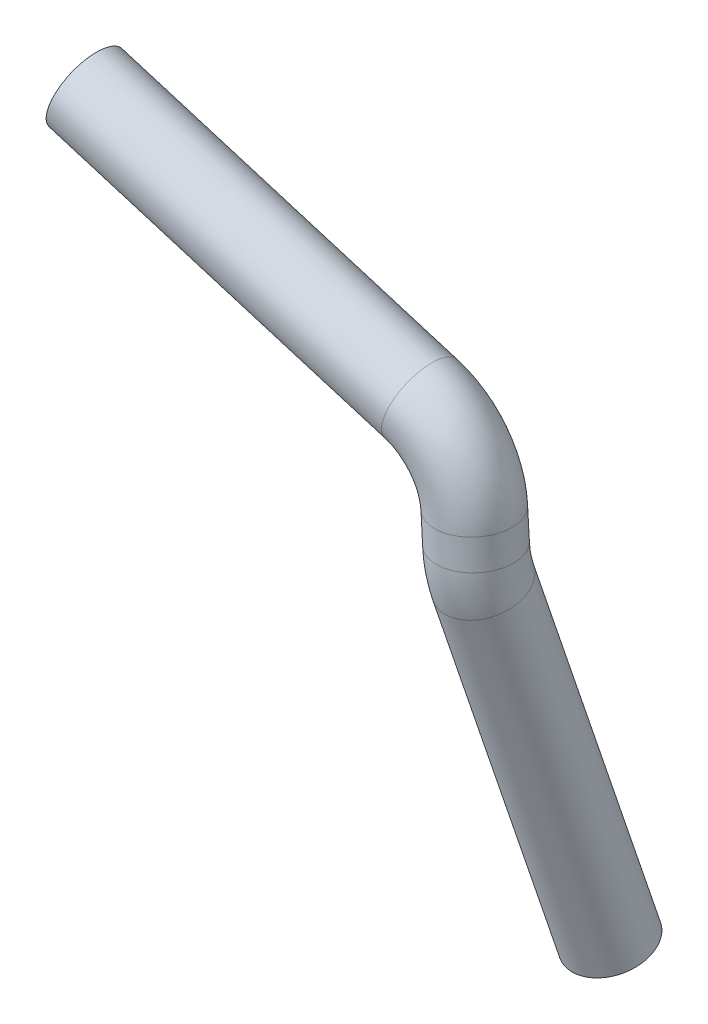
from build123d import *

# Parameters (mm, degrees)
ESQUISSE2_R   = 15
ESQUISSE2_R_2 = 13


with BuildPart() as part:
    # Balayage1: sweep along a curve in space
    with BuildLine() as balayage1_path:
        Line((-155.346467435, 86.28634243, 0), (-22.31184026, 46.02398852, 0))
        ThreePointArc((-22.31184026, 46.02398852, 0), (-7.413871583, 35.846717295, 0), (-1.047613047, 18.964860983, 0))
        Line((-1.047613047, 18.964860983, 0), (-0.387970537, 7.023401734, 0))
        ThreePointArc((-0.387970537, 7.023401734, 0), (0.03957758, 0.070882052, -0.485623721), (0.545508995, -6.7412559, -1.933024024))
        Line((0.545508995, -6.7412559, -1.933024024), (11.632794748, -143.755001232, -41.221083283))
    # Esquisse2 → Balayage1 (sweep)
    with BuildSketch(Plane(origin=(11.632794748, -143.755001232, -41.221083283), x_dir=(0.9969883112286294, 0.07454773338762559, 0.021376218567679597), z_dir=(0.07755196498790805, -0.9583666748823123, -0.2748072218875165))):
        Circle(ESQUISSE2_R)
        Circle(ESQUISSE2_R_2, mode=Mode.SUBTRACT)
    sweep(path=balayage1_path.line)


solid = part.part
